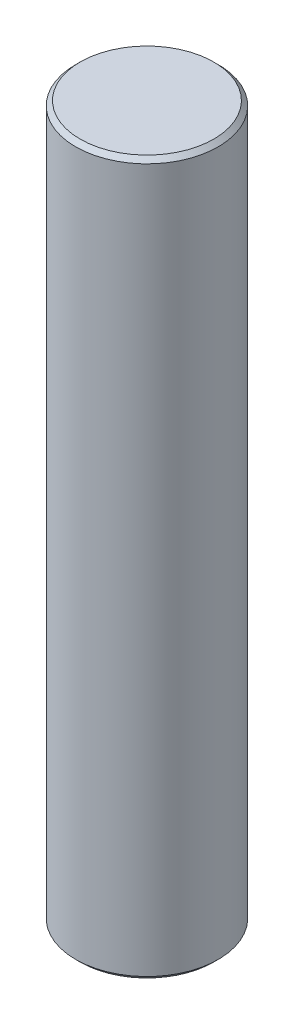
from build123d import *

# Parameters (mm, degrees)
ESQUISSE1_R      = 8
EXTRUSION1_DEPTH = 80
CHANFREIN1_SIZE  = 0.5


with BuildPart() as part:
    # Esquisse1 → Extrusion1 (new body)
    with BuildSketch(Plane(origin=(0, 0, 0), x_dir=(1, 0, 0), z_dir=(0, 1, 0))):
        with Locations(Location((0, 0, 0), (0, 0, 270))):
            Circle(ESQUISSE1_R)
    extrude(amount=EXTRUSION1_DEPTH)

    # Chanfrein1
    chanfrein1_edges = [part.edges().sort_by_distance(p)[0] for p in [
        (0, 0, -8),
        (0, 80, -8),
    ]]
    chamfer(chanfrein1_edges, length=CHANFREIN1_SIZE)


solid = part.part
